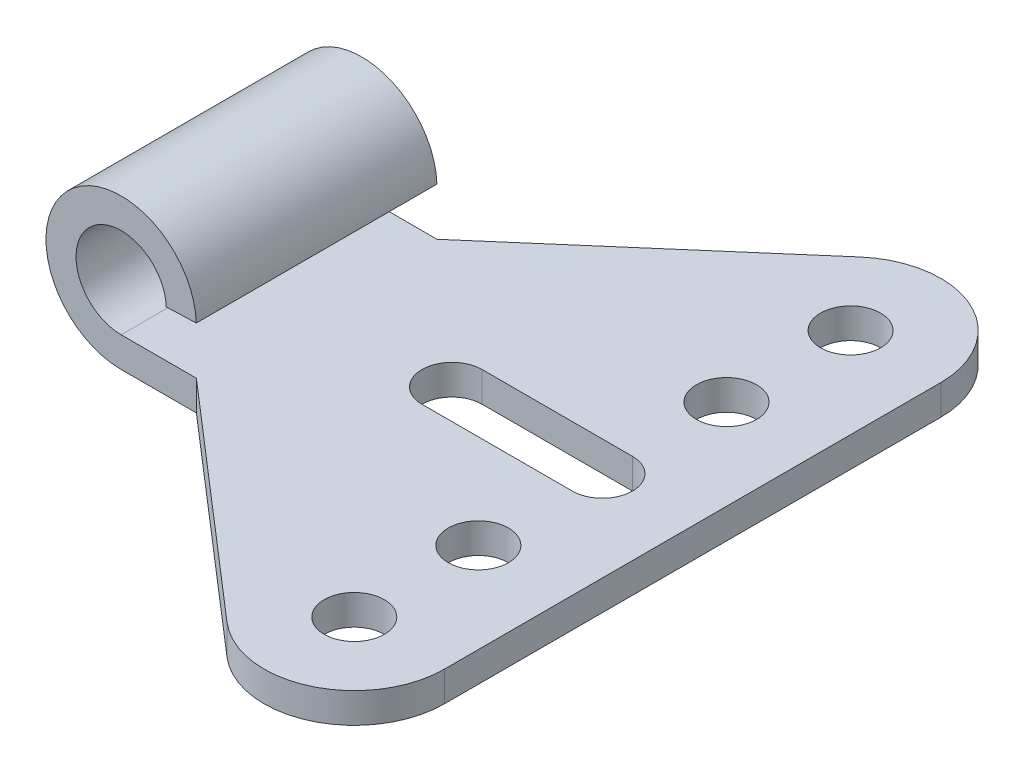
ISO-10303-21;
HEADER;
FILE_DESCRIPTION(('STEP AP214'),'2;1');
FILE_NAME('part.step','',(''),(''),'','','');
FILE_SCHEMA(('AUTOMOTIVE_DESIGN { 1 0 10303 214 1 1 1 1 }'));
ENDSEC;
DATA;
#1=APPLICATION_CONTEXT('core data for automotive mechanical design processes');
#2=APPLICATION_PROTOCOL_DEFINITION('international standard','automotive_design',2000,#1);
#3=PRODUCT_CONTEXT('',#1,'mechanical');
#4=PRODUCT('Part','Part','',(#3));
#5=PRODUCT_RELATED_PRODUCT_CATEGORY('part','',(#4));
#6=PRODUCT_DEFINITION_FORMATION('','',#4);
#7=PRODUCT_DEFINITION_CONTEXT('part definition',#1,'design');
#8=PRODUCT_DEFINITION('design','',#6,#7);
#9=PRODUCT_DEFINITION_SHAPE('','',#8);
#10=(LENGTH_UNIT() NAMED_UNIT(*) SI_UNIT(.MILLI.,.METRE.));
#11=(NAMED_UNIT(*) PLANE_ANGLE_UNIT() SI_UNIT($,.RADIAN.));
#12=(NAMED_UNIT(*) SI_UNIT($,.STERADIAN.) SOLID_ANGLE_UNIT());
#13=UNCERTAINTY_MEASURE_WITH_UNIT(LENGTH_MEASURE(1.E-05),#10,'distance_accuracy_value','');
#14=(GEOMETRIC_REPRESENTATION_CONTEXT(3) GLOBAL_UNCERTAINTY_ASSIGNED_CONTEXT((#13)) GLOBAL_UNIT_ASSIGNED_CONTEXT((#10,
#11,#12)) REPRESENTATION_CONTEXT('',''));
#15=CARTESIAN_POINT('',(0.,0.,0.));
#16=DIRECTION('',(0.,0.,1.));
#17=DIRECTION('',(1.,0.,0.));
#18=AXIS2_PLACEMENT_3D('',#15,#16,#17);
#19=CARTESIAN_POINT('',(0.,-3.,8.));
#20=DIRECTION('',(0.,1.,0.));
#21=DIRECTION('',(0.,0.,1.));
#22=AXIS2_PLACEMENT_3D('',#19,#20,#21);
#23=PLANE('',#22);
#24=CARTESIAN_POINT('',(24.,-3.,-8.25));
#25=DIRECTION('',(0.,-1.,0.));
#26=DIRECTION('',(0.,0.,-1.));
#27=AXIS2_PLACEMENT_3D('',#24,#25,#26);
#28=CIRCLE('',#27,2.);
#29=CARTESIAN_POINT('',(24.,-3.,-10.25));
#30=VERTEX_POINT('',#29);
#31=EDGE_CURVE('E150',#30,#30,#28,.T.);
#32=ORIENTED_EDGE('',*,*,#31,.T.);
#33=EDGE_LOOP('',(#32));
#34=FACE_BOUND('',#33,.T.);
#35=DIRECTION('',(1.,0.,0.));
#36=VECTOR('',#35,1.);
#37=CARTESIAN_POINT('',(0.,-3.,-8.));
#38=LINE('',#37,#36);
#39=CARTESIAN_POINT('',(0.,-3.,-8.));
#40=VERTEX_POINT('',#39);
#41=CARTESIAN_POINT('',(5.,-3.,-8.));
#42=VERTEX_POINT('',#41);
#43=EDGE_CURVE('E243',#40,#42,#38,.T.);
#44=ORIENTED_EDGE('',*,*,#43,.F.);
#45=DIRECTION('',(0.,0.,-1.));
#46=VECTOR('',#45,1.);
#47=CARTESIAN_POINT('',(0.,-3.,8.));
#48=LINE('',#47,#46);
#49=CARTESIAN_POINT('',(0.,-3.,8.));
#50=VERTEX_POINT('',#49);
#51=EDGE_CURVE('E11',#50,#40,#48,.T.);
#52=ORIENTED_EDGE('',*,*,#51,.F.);
#53=DIRECTION('',(1.,0.,0.));
#54=VECTOR('',#53,1.);
#55=CARTESIAN_POINT('',(0.,-3.,8.));
#56=LINE('',#55,#54);
#57=CARTESIAN_POINT('',(5.,-3.,8.));
#58=VERTEX_POINT('',#57);
#59=EDGE_CURVE('E257',#50,#58,#56,.T.);
#60=ORIENTED_EDGE('',*,*,#59,.T.);
#61=DIRECTION('',(0.75635660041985,0.,0.654159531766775));
#62=VECTOR('',#61,1.);
#63=CARTESIAN_POINT('',(5.,-3.,8.));
#64=LINE('',#63,#62);
#65=CARTESIAN_POINT('',(20.0750428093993,-3.,21.0381396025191));
#66=VERTEX_POINT('',#65);
#67=EDGE_CURVE('E194',#58,#66,#64,.T.);
#68=ORIENTED_EDGE('',*,*,#67,.T.);
#69=CARTESIAN_POINT('',(24.,-3.,16.5));
#70=DIRECTION('',(0.,1.,0.));
#71=DIRECTION('',(0.,0.,1.));
#72=AXIS2_PLACEMENT_3D('',#69,#70,#71);
#73=CIRCLE('',#72,6.);
#74=CARTESIAN_POINT('',(30.,-3.,16.5));
#75=VERTEX_POINT('',#74);
#76=EDGE_CURVE('E211',#66,#75,#73,.T.);
#77=ORIENTED_EDGE('',*,*,#76,.T.);
#78=DIRECTION('',(0.,0.,1.));
#79=VECTOR('',#78,1.);
#80=CARTESIAN_POINT('',(30.,-3.,-16.5));
#81=LINE('',#80,#79);
#82=CARTESIAN_POINT('',(30.,-3.,-16.5));
#83=VERTEX_POINT('',#82);
#84=EDGE_CURVE('E214',#83,#75,#81,.T.);
#85=ORIENTED_EDGE('',*,*,#84,.F.);
#86=CARTESIAN_POINT('',(24.,-3.,-16.5));
#87=DIRECTION('',(0.,-1.,0.));
#88=DIRECTION('',(0.,0.,-1.));
#89=AXIS2_PLACEMENT_3D('',#86,#87,#88);
#90=CIRCLE('',#89,6.);
#91=CARTESIAN_POINT('',(20.0750428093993,-3.,-21.0381396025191));
#92=VERTEX_POINT('',#91);
#93=EDGE_CURVE('E217',#92,#83,#90,.T.);
#94=ORIENTED_EDGE('',*,*,#93,.F.);
#95=DIRECTION('',(0.756356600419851,0.,-0.654159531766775));
#96=VECTOR('',#95,1.);
#97=CARTESIAN_POINT('',(5.,-3.,-8.));
#98=LINE('',#97,#96);
#99=EDGE_CURVE('E220',#42,#92,#98,.T.);
#100=ORIENTED_EDGE('',*,*,#99,.F.);
#101=EDGE_LOOP('',(#44,#52,#60,#68,#77,#85,#94,#100));
#102=FACE_BOUND('',#101,.T.);
#103=CARTESIAN_POINT('',(24.,-3.,16.5));
#104=DIRECTION('',(0.,1.,0.));
#105=DIRECTION('',(0.,0.,1.));
#106=AXIS2_PLACEMENT_3D('',#103,#104,#105);
#107=CIRCLE('',#106,2.);
#108=CARTESIAN_POINT('',(24.,-3.,18.5));
#109=VERTEX_POINT('',#108);
#110=EDGE_CURVE('E188',#109,#109,#107,.T.);
#111=ORIENTED_EDGE('',*,*,#110,.F.);
#112=EDGE_LOOP('',(#111));
#113=FACE_BOUND('',#112,.T.);
#114=CARTESIAN_POINT('',(24.,-3.,8.25));
#115=DIRECTION('',(0.,1.,0.));
#116=DIRECTION('',(0.,0.,1.));
#117=AXIS2_PLACEMENT_3D('',#114,#115,#116);
#118=CIRCLE('',#117,2.);
#119=CARTESIAN_POINT('',(24.,-3.,10.25));
#120=VERTEX_POINT('',#119);
#121=EDGE_CURVE('E182',#120,#120,#118,.T.);
#122=ORIENTED_EDGE('',*,*,#121,.F.);
#123=EDGE_LOOP('',(#122));
#124=FACE_BOUND('',#123,.T.);
#125=CARTESIAN_POINT('',(24.,-3.,-16.5));
#126=DIRECTION('',(0.,-1.,0.));
#127=DIRECTION('',(0.,0.,-1.));
#128=AXIS2_PLACEMENT_3D('',#125,#126,#127);
#129=CIRCLE('',#128,2.);
#130=CARTESIAN_POINT('',(24.,-3.,-18.5));
#131=VERTEX_POINT('',#130);
#132=EDGE_CURVE('E176',#131,#131,#129,.T.);
#133=ORIENTED_EDGE('',*,*,#132,.T.);
#134=EDGE_LOOP('',(#133));
#135=FACE_BOUND('',#134,.T.);
#136=DIRECTION('',(-1.,0.,0.));
#137=VECTOR('',#136,1.);
#138=CARTESIAN_POINT('',(24.,-3.,-2.));
#139=LINE('',#138,#137);
#140=CARTESIAN_POINT('',(24.,-3.,-2.));
#141=VERTEX_POINT('',#140);
#142=CARTESIAN_POINT('',(14.,-3.,-2.));
#143=VERTEX_POINT('',#142);
#144=EDGE_CURVE('E154',#141,#143,#139,.T.);
#145=ORIENTED_EDGE('',*,*,#144,.F.);
#146=CARTESIAN_POINT('',(24.,-3.,0.));
#147=DIRECTION('',(0.,-1.,0.));
#148=DIRECTION('',(0.,0.,-1.));
#149=AXIS2_PLACEMENT_3D('',#146,#147,#148);
#150=CIRCLE('',#149,2.);
#151=CARTESIAN_POINT('',(24.,-3.,2.));
#152=VERTEX_POINT('',#151);
#153=EDGE_CURVE('E50',#141,#152,#150,.T.);
#154=ORIENTED_EDGE('',*,*,#153,.T.);
#155=DIRECTION('',(-1.,0.,0.));
#156=VECTOR('',#155,1.);
#157=CARTESIAN_POINT('',(24.,-3.,2.));
#158=LINE('',#157,#156);
#159=CARTESIAN_POINT('',(14.,-3.,2.));
#160=VERTEX_POINT('',#159);
#161=EDGE_CURVE('E137',#152,#160,#158,.T.);
#162=ORIENTED_EDGE('',*,*,#161,.T.);
#163=CARTESIAN_POINT('',(14.,-3.,0.));
#164=DIRECTION('',(0.,1.,0.));
#165=DIRECTION('',(0.,0.,1.));
#166=AXIS2_PLACEMENT_3D('',#163,#164,#165);
#167=CIRCLE('',#166,2.);
#168=EDGE_CURVE('E145',#143,#160,#167,.T.);
#169=ORIENTED_EDGE('',*,*,#168,.F.);
#170=EDGE_LOOP('',(#145,#154,#162,#169));
#171=FACE_BOUND('',#170,.T.);
#172=ADVANCED_FACE('F33',(#34,#102,#113,#124,#135,#171),#23,.T.);
#173=CARTESIAN_POINT('',(0.,-5.,8.));
#174=DIRECTION('',(0.,1.,0.));
#175=DIRECTION('',(0.,0.,1.));
#176=AXIS2_PLACEMENT_3D('',#173,#174,#175);
#177=PLANE('',#176);
#178=CARTESIAN_POINT('',(24.,-5.,-8.25));
#179=DIRECTION('',(0.,-1.,0.));
#180=DIRECTION('',(0.,0.,-1.));
#181=AXIS2_PLACEMENT_3D('',#178,#179,#180);
#182=CIRCLE('',#181,2.);
#183=CARTESIAN_POINT('',(24.,-5.,-10.25));
#184=VERTEX_POINT('',#183);
#185=EDGE_CURVE('E173',#184,#184,#182,.T.);
#186=ORIENTED_EDGE('',*,*,#185,.F.);
#187=EDGE_LOOP('',(#186));
#188=FACE_BOUND('',#187,.T.);
#189=DIRECTION('',(1.,0.,0.));
#190=VECTOR('',#189,1.);
#191=CARTESIAN_POINT('',(0.,-5.,-8.));
#192=LINE('',#191,#190);
#193=CARTESIAN_POINT('',(0.,-5.,-8.));
#194=VERTEX_POINT('',#193);
#195=CARTESIAN_POINT('',(5.,-5.,-8.));
#196=VERTEX_POINT('',#195);
#197=EDGE_CURVE('E233',#194,#196,#192,.T.);
#198=ORIENTED_EDGE('',*,*,#197,.T.);
#199=DIRECTION('',(-0.756356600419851,0.,0.654159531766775));
#200=VECTOR('',#199,1.);
#201=CARTESIAN_POINT('',(5.,-5.,-8.));
#202=LINE('',#201,#200);
#203=CARTESIAN_POINT('',(20.0750428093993,-5.,-21.0381396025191));
#204=VERTEX_POINT('',#203);
#205=EDGE_CURVE('E202',#204,#196,#202,.T.);
#206=ORIENTED_EDGE('',*,*,#205,.F.);
#207=CARTESIAN_POINT('',(24.,-5.,-16.5));
#208=DIRECTION('',(0.,1.,0.));
#209=DIRECTION('',(0.,0.,1.));
#210=AXIS2_PLACEMENT_3D('',#207,#208,#209);
#211=CIRCLE('',#210,6.);
#212=CARTESIAN_POINT('',(30.,-5.,-16.5));
#213=VERTEX_POINT('',#212);
#214=EDGE_CURVE('E198',#213,#204,#211,.T.);
#215=ORIENTED_EDGE('',*,*,#214,.F.);
#216=DIRECTION('',(0.,0.,-1.));
#217=VECTOR('',#216,1.);
#218=CARTESIAN_POINT('',(30.,-5.,-16.5));
#219=LINE('',#218,#217);
#220=CARTESIAN_POINT('',(30.,-5.,16.5));
#221=VERTEX_POINT('',#220);
#222=EDGE_CURVE('E195',#221,#213,#219,.T.);
#223=ORIENTED_EDGE('',*,*,#222,.F.);
#224=CARTESIAN_POINT('',(24.,-5.,16.5));
#225=DIRECTION('',(0.,1.,0.));
#226=DIRECTION('',(0.,0.,1.));
#227=AXIS2_PLACEMENT_3D('',#224,#225,#226);
#228=CIRCLE('',#227,6.);
#229=CARTESIAN_POINT('',(20.0750428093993,-5.,21.0381396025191));
#230=VERTEX_POINT('',#229);
#231=EDGE_CURVE('E208',#221,#230,#228,.F.);
#232=ORIENTED_EDGE('',*,*,#231,.T.);
#233=DIRECTION('',(-0.756356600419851,0.,-0.654159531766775));
#234=VECTOR('',#233,1.);
#235=CARTESIAN_POINT('',(5.,-5.,8.));
#236=LINE('',#235,#234);
#237=CARTESIAN_POINT('',(5.,-5.,8.));
#238=VERTEX_POINT('',#237);
#239=EDGE_CURVE('E205',#230,#238,#236,.T.);
#240=ORIENTED_EDGE('',*,*,#239,.T.);
#241=DIRECTION('',(1.,0.,0.));
#242=VECTOR('',#241,1.);
#243=CARTESIAN_POINT('',(0.,-5.,8.));
#244=LINE('',#243,#242);
#245=CARTESIAN_POINT('',(0.,-5.,8.));
#246=VERTEX_POINT('',#245);
#247=EDGE_CURVE('E248',#246,#238,#244,.T.);
#248=ORIENTED_EDGE('',*,*,#247,.F.);
#249=DIRECTION('',(0.,0.,-1.));
#250=VECTOR('',#249,1.);
#251=CARTESIAN_POINT('',(0.,-5.,8.));
#252=LINE('',#251,#250);
#253=EDGE_CURVE('E37',#246,#194,#252,.T.);
#254=ORIENTED_EDGE('',*,*,#253,.T.);
#255=EDGE_LOOP('',(#198,#206,#215,#223,#232,#240,#248,#254));
#256=FACE_BOUND('',#255,.T.);
#257=CARTESIAN_POINT('',(24.,-5.,16.5));
#258=DIRECTION('',(0.,1.,0.));
#259=DIRECTION('',(0.,0.,1.));
#260=AXIS2_PLACEMENT_3D('',#257,#258,#259);
#261=CIRCLE('',#260,2.);
#262=CARTESIAN_POINT('',(24.,-5.,18.5));
#263=VERTEX_POINT('',#262);
#264=EDGE_CURVE('E191',#263,#263,#261,.T.);
#265=ORIENTED_EDGE('',*,*,#264,.T.);
#266=EDGE_LOOP('',(#265));
#267=FACE_BOUND('',#266,.T.);
#268=CARTESIAN_POINT('',(24.,-5.,8.25));
#269=DIRECTION('',(0.,1.,0.));
#270=DIRECTION('',(0.,0.,1.));
#271=AXIS2_PLACEMENT_3D('',#268,#269,#270);
#272=CIRCLE('',#271,2.);
#273=CARTESIAN_POINT('',(24.,-5.,10.25));
#274=VERTEX_POINT('',#273);
#275=EDGE_CURVE('E185',#274,#274,#272,.T.);
#276=ORIENTED_EDGE('',*,*,#275,.T.);
#277=EDGE_LOOP('',(#276));
#278=FACE_BOUND('',#277,.T.);
#279=CARTESIAN_POINT('',(24.,-5.,-16.5));
#280=DIRECTION('',(0.,-1.,0.));
#281=DIRECTION('',(0.,0.,-1.));
#282=AXIS2_PLACEMENT_3D('',#279,#280,#281);
#283=CIRCLE('',#282,2.);
#284=CARTESIAN_POINT('',(24.,-5.,-18.5));
#285=VERTEX_POINT('',#284);
#286=EDGE_CURVE('E179',#285,#285,#283,.T.);
#287=ORIENTED_EDGE('',*,*,#286,.F.);
#288=EDGE_LOOP('',(#287));
#289=FACE_BOUND('',#288,.T.);
#290=CARTESIAN_POINT('',(24.,-5.,0.));
#291=DIRECTION('',(0.,-1.,0.));
#292=DIRECTION('',(0.,0.,-1.));
#293=AXIS2_PLACEMENT_3D('',#290,#291,#292);
#294=CIRCLE('',#293,2.);
#295=CARTESIAN_POINT('',(24.,-5.,-2.));
#296=VERTEX_POINT('',#295);
#297=CARTESIAN_POINT('',(24.,-5.,2.));
#298=VERTEX_POINT('',#297);
#299=EDGE_CURVE('E149',#296,#298,#294,.T.);
#300=ORIENTED_EDGE('',*,*,#299,.F.);
#301=DIRECTION('',(-1.,0.,0.));
#302=VECTOR('',#301,1.);
#303=CARTESIAN_POINT('',(24.,-5.,-2.));
#304=LINE('',#303,#302);
#305=CARTESIAN_POINT('',(14.,-5.,-2.));
#306=VERTEX_POINT('',#305);
#307=EDGE_CURVE('E163',#296,#306,#304,.T.);
#308=ORIENTED_EDGE('',*,*,#307,.T.);
#309=CARTESIAN_POINT('',(14.,-5.,0.));
#310=DIRECTION('',(0.,1.,0.));
#311=DIRECTION('',(0.,0.,1.));
#312=AXIS2_PLACEMENT_3D('',#309,#310,#311);
#313=CIRCLE('',#312,2.);
#314=CARTESIAN_POINT('',(14.,-5.,2.));
#315=VERTEX_POINT('',#314);
#316=EDGE_CURVE('E58',#306,#315,#313,.T.);
#317=ORIENTED_EDGE('',*,*,#316,.T.);
#318=DIRECTION('',(-1.,0.,0.));
#319=VECTOR('',#318,1.);
#320=CARTESIAN_POINT('',(24.,-5.,2.));
#321=LINE('',#320,#319);
#322=EDGE_CURVE('E160',#298,#315,#321,.T.);
#323=ORIENTED_EDGE('',*,*,#322,.F.);
#324=EDGE_LOOP('',(#300,#308,#317,#323));
#325=FACE_BOUND('',#324,.T.);
#326=ADVANCED_FACE('F35',(#188,#256,#267,#278,#289,#325),#177,.F.);
#327=CARTESIAN_POINT('',(0.,0.,8.));
#328=DIRECTION('',(0.,0.,-1.));
#329=DIRECTION('',(-1.,0.,0.));
#330=AXIS2_PLACEMENT_3D('',#327,#328,#329);
#331=CYLINDRICAL_SURFACE('',#330,3.);
#332=CARTESIAN_POINT('',(0.,0.,-8.));
#333=DIRECTION('',(0.,0.,1.));
#334=DIRECTION('',(1.,0.,0.));
#335=AXIS2_PLACEMENT_3D('',#332,#333,#334);
#336=CIRCLE('',#335,3.);
#337=CARTESIAN_POINT('',(2.99817248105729,0.104698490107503,-8.));
#338=VERTEX_POINT('',#337);
#339=EDGE_CURVE('E240',#338,#40,#336,.T.);
#340=ORIENTED_EDGE('',*,*,#339,.F.);
#341=DIRECTION('',(0.,0.,-1.));
#342=VECTOR('',#341,1.);
#343=CARTESIAN_POINT('',(2.99817248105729,0.104698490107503,8.));
#344=LINE('',#343,#342);
#345=CARTESIAN_POINT('',(2.99817248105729,0.104698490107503,8.));
#346=VERTEX_POINT('',#345);
#347=EDGE_CURVE('E42',#346,#338,#344,.T.);
#348=ORIENTED_EDGE('',*,*,#347,.F.);
#349=CARTESIAN_POINT('',(0.,0.,8.));
#350=DIRECTION('',(0.,0.,1.));
#351=DIRECTION('',(1.,0.,0.));
#352=AXIS2_PLACEMENT_3D('',#349,#350,#351);
#353=CIRCLE('',#352,3.);
#354=EDGE_CURVE('E254',#346,#50,#353,.T.);
#355=ORIENTED_EDGE('',*,*,#354,.T.);
#356=ORIENTED_EDGE('',*,*,#51,.T.);
#357=EDGE_LOOP('',(#340,#348,#355,#356));
#358=FACE_BOUND('',#357,.T.);
#359=ADVANCED_FACE('F306',(#358),#331,.F.);
#360=CARTESIAN_POINT('',(2.99817248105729,0.104698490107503,8.));
#361=DIRECTION('',(-0.034899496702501,0.999390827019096,0.));
#362=DIRECTION('',(-0.999390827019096,-0.034899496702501,0.));
#363=AXIS2_PLACEMENT_3D('',#360,#361,#362);
#364=PLANE('',#363);
#365=DIRECTION('',(0.999390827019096,0.034899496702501,0.));
#366=VECTOR('',#365,1.);
#367=CARTESIAN_POINT('',(2.99817248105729,0.104698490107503,-8.));
#368=LINE('',#367,#366);
#369=CARTESIAN_POINT('',(4.99695413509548,0.174497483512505,-8.));
#370=VERTEX_POINT('',#369);
#371=EDGE_CURVE('E238',#338,#370,#368,.T.);
#372=ORIENTED_EDGE('',*,*,#371,.T.);
#373=DIRECTION('',(0.,0.,-1.));
#374=VECTOR('',#373,1.);
#375=CARTESIAN_POINT('',(4.99695413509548,0.174497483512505,8.));
#376=LINE('',#375,#374);
#377=CARTESIAN_POINT('',(4.99695413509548,0.174497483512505,8.));
#378=VERTEX_POINT('',#377);
#379=EDGE_CURVE('E260',#378,#370,#376,.T.);
#380=ORIENTED_EDGE('',*,*,#379,.F.);
#381=DIRECTION('',(0.999390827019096,0.034899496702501,0.));
#382=VECTOR('',#381,1.);
#383=CARTESIAN_POINT('',(2.99817248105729,0.104698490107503,8.));
#384=LINE('',#383,#382);
#385=EDGE_CURVE('E252',#346,#378,#384,.T.);
#386=ORIENTED_EDGE('',*,*,#385,.F.);
#387=ORIENTED_EDGE('',*,*,#347,.T.);
#388=EDGE_LOOP('',(#372,#380,#386,#387));
#389=FACE_BOUND('',#388,.T.);
#390=ADVANCED_FACE('F309',(#389),#364,.F.);
#391=CARTESIAN_POINT('',(0.,0.,8.));
#392=DIRECTION('',(0.,0.,-1.));
#393=DIRECTION('',(-1.,0.,0.));
#394=AXIS2_PLACEMENT_3D('',#391,#392,#393);
#395=CYLINDRICAL_SURFACE('',#394,5.);
#396=CARTESIAN_POINT('',(0.,0.,-8.));
#397=DIRECTION('',(0.,0.,1.));
#398=DIRECTION('',(1.,0.,0.));
#399=AXIS2_PLACEMENT_3D('',#396,#397,#398);
#400=CIRCLE('',#399,5.);
#401=EDGE_CURVE('E236',#370,#194,#400,.T.);
#402=ORIENTED_EDGE('',*,*,#401,.T.);
#403=ORIENTED_EDGE('',*,*,#253,.F.);
#404=CARTESIAN_POINT('',(0.,0.,8.));
#405=DIRECTION('',(0.,0.,1.));
#406=DIRECTION('',(1.,0.,0.));
#407=AXIS2_PLACEMENT_3D('',#404,#405,#406);
#408=CIRCLE('',#407,5.);
#409=EDGE_CURVE('E250',#378,#246,#408,.T.);
#410=ORIENTED_EDGE('',*,*,#409,.F.);
#411=ORIENTED_EDGE('',*,*,#379,.T.);
#412=EDGE_LOOP('',(#402,#403,#410,#411));
#413=FACE_BOUND('',#412,.T.);
#414=ADVANCED_FACE('F310',(#413),#395,.T.);
#415=CARTESIAN_POINT('',(0.,0.,8.));
#416=DIRECTION('',(0.,0.,1.));
#417=DIRECTION('',(1.,0.,0.));
#418=AXIS2_PLACEMENT_3D('',#415,#416,#417);
#419=PLANE('',#418);
#420=DIRECTION('',(0.,-1.,0.));
#421=VECTOR('',#420,1.);
#422=CARTESIAN_POINT('',(5.,-3.,8.));
#423=LINE('',#422,#421);
#424=EDGE_CURVE('E245',#58,#238,#423,.T.);
#425=ORIENTED_EDGE('',*,*,#424,.F.);
#426=ORIENTED_EDGE('',*,*,#59,.F.);
#427=ORIENTED_EDGE('',*,*,#354,.F.);
#428=ORIENTED_EDGE('',*,*,#385,.T.);
#429=ORIENTED_EDGE('',*,*,#409,.T.);
#430=ORIENTED_EDGE('',*,*,#247,.T.);
#431=EDGE_LOOP('',(#425,#426,#427,#428,#429,#430));
#432=FACE_BOUND('',#431,.T.);
#433=ADVANCED_FACE('F302',(#432),#419,.T.);
#434=CARTESIAN_POINT('',(0.,0.,-8.));
#435=DIRECTION('',(0.,0.,1.));
#436=DIRECTION('',(1.,0.,0.));
#437=AXIS2_PLACEMENT_3D('',#434,#435,#436);
#438=PLANE('',#437);
#439=DIRECTION('',(0.,-1.,0.));
#440=VECTOR('',#439,1.);
#441=CARTESIAN_POINT('',(5.,-3.,-8.));
#442=LINE('',#441,#440);
#443=EDGE_CURVE('E231',#42,#196,#442,.T.);
#444=ORIENTED_EDGE('',*,*,#443,.T.);
#445=ORIENTED_EDGE('',*,*,#197,.F.);
#446=ORIENTED_EDGE('',*,*,#401,.F.);
#447=ORIENTED_EDGE('',*,*,#371,.F.);
#448=ORIENTED_EDGE('',*,*,#339,.T.);
#449=ORIENTED_EDGE('',*,*,#43,.T.);
#450=EDGE_LOOP('',(#444,#445,#446,#447,#448,#449));
#451=FACE_BOUND('',#450,.T.);
#452=ADVANCED_FACE('F273',(#451),#438,.F.);
#453=CARTESIAN_POINT('',(5.,-5.001,8.));
#454=DIRECTION('',(-0.654159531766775,0.,0.75635660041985));
#455=DIRECTION('',(0.756356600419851,0.,0.654159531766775));
#456=AXIS2_PLACEMENT_3D('',#453,#454,#455);
#457=PLANE('',#456);
#458=ORIENTED_EDGE('',*,*,#239,.F.);
#459=DIRECTION('',(0.,1.,0.));
#460=VECTOR('',#459,1.);
#461=CARTESIAN_POINT('',(20.0750428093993,-5.001,21.0381396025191));
#462=LINE('',#461,#460);
#463=EDGE_CURVE('E223',#230,#66,#462,.T.);
#464=ORIENTED_EDGE('',*,*,#463,.T.);
#465=ORIENTED_EDGE('',*,*,#67,.F.);
#466=ORIENTED_EDGE('',*,*,#424,.T.);
#467=EDGE_LOOP('',(#458,#464,#465,#466));
#468=FACE_BOUND('',#467,.T.);
#469=ADVANCED_FACE('F298',(#468),#457,.T.);
#470=CARTESIAN_POINT('',(5.,-5.001,-8.));
#471=DIRECTION('',(0.654159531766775,0.,0.756356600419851));
#472=DIRECTION('',(0.756356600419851,0.,-0.654159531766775));
#473=AXIS2_PLACEMENT_3D('',#470,#471,#472);
#474=PLANE('',#473);
#475=DIRECTION('',(0.,1.,0.));
#476=VECTOR('',#475,1.);
#477=CARTESIAN_POINT('',(20.0750428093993,-5.001,-21.0381396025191));
#478=LINE('',#477,#476);
#479=EDGE_CURVE('E199',#204,#92,#478,.T.);
#480=ORIENTED_EDGE('',*,*,#479,.F.);
#481=ORIENTED_EDGE('',*,*,#205,.T.);
#482=ORIENTED_EDGE('',*,*,#443,.F.);
#483=ORIENTED_EDGE('',*,*,#99,.T.);
#484=EDGE_LOOP('',(#480,#481,#482,#483));
#485=FACE_BOUND('',#484,.T.);
#486=ADVANCED_FACE('F280',(#485),#474,.F.);
#487=CARTESIAN_POINT('',(24.,-5.001,-16.5));
#488=DIRECTION('',(0.,1.,0.));
#489=DIRECTION('',(0.,0.,1.));
#490=AXIS2_PLACEMENT_3D('',#487,#488,#489);
#491=CYLINDRICAL_SURFACE('',#490,6.);
#492=DIRECTION('',(0.,1.,0.));
#493=VECTOR('',#492,1.);
#494=CARTESIAN_POINT('',(30.,-5.001,-16.5));
#495=LINE('',#494,#493);
#496=EDGE_CURVE('E225',#213,#83,#495,.T.);
#497=ORIENTED_EDGE('',*,*,#496,.F.);
#498=ORIENTED_EDGE('',*,*,#214,.T.);
#499=ORIENTED_EDGE('',*,*,#479,.T.);
#500=ORIENTED_EDGE('',*,*,#93,.T.);
#501=EDGE_LOOP('',(#497,#498,#499,#500));
#502=FACE_BOUND('',#501,.T.);
#503=ADVANCED_FACE('F287',(#502),#491,.T.);
#504=CARTESIAN_POINT('',(30.,-5.001,-16.5));
#505=DIRECTION('',(-1.,0.,0.));
#506=DIRECTION('',(0.,0.,1.));
#507=AXIS2_PLACEMENT_3D('',#504,#505,#506);
#508=PLANE('',#507);
#509=DIRECTION('',(0.,1.,0.));
#510=VECTOR('',#509,1.);
#511=CARTESIAN_POINT('',(30.,-5.001,16.5));
#512=LINE('',#511,#510);
#513=EDGE_CURVE('E227',#221,#75,#512,.T.);
#514=ORIENTED_EDGE('',*,*,#513,.F.);
#515=ORIENTED_EDGE('',*,*,#222,.T.);
#516=ORIENTED_EDGE('',*,*,#496,.T.);
#517=ORIENTED_EDGE('',*,*,#84,.T.);
#518=EDGE_LOOP('',(#514,#515,#516,#517));
#519=FACE_BOUND('',#518,.T.);
#520=ADVANCED_FACE('F290',(#519),#508,.F.);
#521=CARTESIAN_POINT('',(24.,-5.001,16.5));
#522=DIRECTION('',(0.,1.,0.));
#523=DIRECTION('',(0.,0.,1.));
#524=AXIS2_PLACEMENT_3D('',#521,#522,#523);
#525=CYLINDRICAL_SURFACE('',#524,6.);
#526=ORIENTED_EDGE('',*,*,#231,.F.);
#527=ORIENTED_EDGE('',*,*,#513,.T.);
#528=ORIENTED_EDGE('',*,*,#76,.F.);
#529=ORIENTED_EDGE('',*,*,#463,.F.);
#530=EDGE_LOOP('',(#526,#527,#528,#529));
#531=FACE_BOUND('',#530,.T.);
#532=ADVANCED_FACE('F295',(#531),#525,.T.);
#533=CARTESIAN_POINT('',(24.,-5.,16.5));
#534=DIRECTION('',(0.,1.,0.));
#535=DIRECTION('',(0.,0.,1.));
#536=AXIS2_PLACEMENT_3D('',#533,#534,#535);
#537=CYLINDRICAL_SURFACE('',#536,2.);
#538=ORIENTED_EDGE('',*,*,#264,.F.);
#539=EDGE_LOOP('',(#538));
#540=FACE_BOUND('',#539,.T.);
#541=ORIENTED_EDGE('',*,*,#110,.T.);
#542=EDGE_LOOP('',(#541));
#543=FACE_BOUND('',#542,.T.);
#544=ADVANCED_FACE('F393',(#540,#543),#537,.F.);
#545=CARTESIAN_POINT('',(24.,-5.,8.25));
#546=DIRECTION('',(0.,1.,0.));
#547=DIRECTION('',(0.,0.,1.));
#548=AXIS2_PLACEMENT_3D('',#545,#546,#547);
#549=CYLINDRICAL_SURFACE('',#548,2.);
#550=ORIENTED_EDGE('',*,*,#275,.F.);
#551=EDGE_LOOP('',(#550));
#552=FACE_BOUND('',#551,.T.);
#553=ORIENTED_EDGE('',*,*,#121,.T.);
#554=EDGE_LOOP('',(#553));
#555=FACE_BOUND('',#554,.T.);
#556=ADVANCED_FACE('F413',(#552,#555),#549,.F.);
#557=CARTESIAN_POINT('',(24.,-5.,-16.5));
#558=DIRECTION('',(0.,1.,0.));
#559=DIRECTION('',(0.,0.,1.));
#560=AXIS2_PLACEMENT_3D('',#557,#558,#559);
#561=CYLINDRICAL_SURFACE('',#560,2.);
#562=ORIENTED_EDGE('',*,*,#286,.T.);
#563=EDGE_LOOP('',(#562));
#564=FACE_BOUND('',#563,.T.);
#565=ORIENTED_EDGE('',*,*,#132,.F.);
#566=EDGE_LOOP('',(#565));
#567=FACE_BOUND('',#566,.T.);
#568=ADVANCED_FACE('F423',(#564,#567),#561,.F.);
#569=CARTESIAN_POINT('',(24.,-5.,-8.25));
#570=DIRECTION('',(0.,1.,0.));
#571=DIRECTION('',(0.,0.,1.));
#572=AXIS2_PLACEMENT_3D('',#569,#570,#571);
#573=CYLINDRICAL_SURFACE('',#572,2.);
#574=ORIENTED_EDGE('',*,*,#185,.T.);
#575=EDGE_LOOP('',(#574));
#576=FACE_BOUND('',#575,.T.);
#577=ORIENTED_EDGE('',*,*,#31,.F.);
#578=EDGE_LOOP('',(#577));
#579=FACE_BOUND('',#578,.T.);
#580=ADVANCED_FACE('F433',(#576,#579),#573,.F.);
#581=CARTESIAN_POINT('',(24.,-5.,0.));
#582=DIRECTION('',(0.,1.,0.));
#583=DIRECTION('',(0.,0.,1.));
#584=AXIS2_PLACEMENT_3D('',#581,#582,#583);
#585=CYLINDRICAL_SURFACE('',#584,2.);
#586=ORIENTED_EDGE('',*,*,#153,.F.);
#587=DIRECTION('',(0.,1.,0.));
#588=VECTOR('',#587,1.);
#589=CARTESIAN_POINT('',(24.,-5.,-2.));
#590=LINE('',#589,#588);
#591=EDGE_CURVE('E166',#296,#141,#590,.T.);
#592=ORIENTED_EDGE('',*,*,#591,.F.);
#593=ORIENTED_EDGE('',*,*,#299,.T.);
#594=DIRECTION('',(0.,1.,0.));
#595=VECTOR('',#594,1.);
#596=CARTESIAN_POINT('',(24.,-5.,2.));
#597=LINE('',#596,#595);
#598=EDGE_CURVE('E139',#298,#152,#597,.T.);
#599=ORIENTED_EDGE('',*,*,#598,.T.);
#600=EDGE_LOOP('',(#586,#592,#593,#599));
#601=FACE_BOUND('',#600,.T.);
#602=ADVANCED_FACE('F147',(#601),#585,.F.);
#603=CARTESIAN_POINT('',(24.,-5.,2.));
#604=DIRECTION('',(0.,0.,-1.));
#605=DIRECTION('',(-1.,0.,0.));
#606=AXIS2_PLACEMENT_3D('',#603,#604,#605);
#607=PLANE('',#606);
#608=ORIENTED_EDGE('',*,*,#161,.F.);
#609=ORIENTED_EDGE('',*,*,#598,.F.);
#610=ORIENTED_EDGE('',*,*,#322,.T.);
#611=DIRECTION('',(0.,1.,0.));
#612=VECTOR('',#611,1.);
#613=CARTESIAN_POINT('',(14.,-5.,2.));
#614=LINE('',#613,#612);
#615=EDGE_CURVE('E141',#315,#160,#614,.T.);
#616=ORIENTED_EDGE('',*,*,#615,.T.);
#617=EDGE_LOOP('',(#608,#609,#610,#616));
#618=FACE_BOUND('',#617,.T.);
#619=ADVANCED_FACE('F138',(#618),#607,.T.);
#620=CARTESIAN_POINT('',(14.,-5.,0.));
#621=DIRECTION('',(0.,1.,0.));
#622=DIRECTION('',(0.,0.,1.));
#623=AXIS2_PLACEMENT_3D('',#620,#621,#622);
#624=CYLINDRICAL_SURFACE('',#623,2.);
#625=ORIENTED_EDGE('',*,*,#168,.T.);
#626=ORIENTED_EDGE('',*,*,#615,.F.);
#627=ORIENTED_EDGE('',*,*,#316,.F.);
#628=DIRECTION('',(0.,1.,0.));
#629=VECTOR('',#628,1.);
#630=CARTESIAN_POINT('',(14.,-5.,-2.));
#631=LINE('',#630,#629);
#632=EDGE_CURVE('E168',#306,#143,#631,.T.);
#633=ORIENTED_EDGE('',*,*,#632,.T.);
#634=EDGE_LOOP('',(#625,#626,#627,#633));
#635=FACE_BOUND('',#634,.T.);
#636=ADVANCED_FACE('F460',(#635),#624,.F.);
#637=CARTESIAN_POINT('',(24.,-5.,-2.));
#638=DIRECTION('',(0.,0.,-1.));
#639=DIRECTION('',(-1.,0.,0.));
#640=AXIS2_PLACEMENT_3D('',#637,#638,#639);
#641=PLANE('',#640);
#642=ORIENTED_EDGE('',*,*,#144,.T.);
#643=ORIENTED_EDGE('',*,*,#632,.F.);
#644=ORIENTED_EDGE('',*,*,#307,.F.);
#645=ORIENTED_EDGE('',*,*,#591,.T.);
#646=EDGE_LOOP('',(#642,#643,#644,#645));
#647=FACE_BOUND('',#646,.T.);
#648=ADVANCED_FACE('F469',(#647),#641,.F.);
#649=CLOSED_SHELL('',(#172,#326,#359,#390,#414,#433,#452,#469,#486,#503,#520,#532,#544,#556,
#568,#580,#602,#619,#636,#648));
#650=MANIFOLD_SOLID_BREP('B2',#649);
#651=ADVANCED_BREP_SHAPE_REPRESENTATION('',(#18,#650),#14);
#652=SHAPE_DEFINITION_REPRESENTATION(#9,#651);
ENDSEC;
END-ISO-10303-21;
